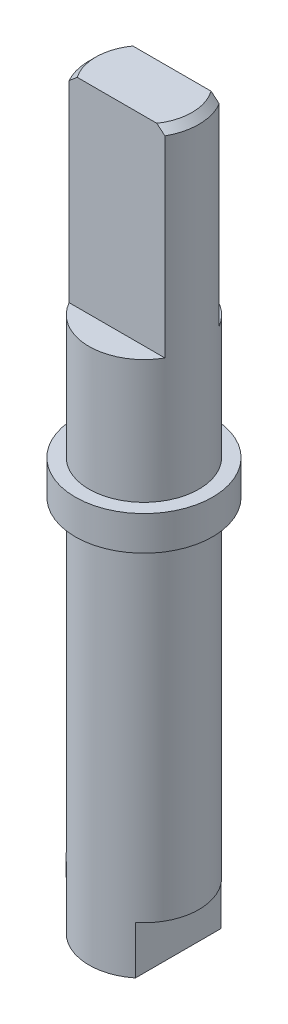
from build123d import *

# Parameters (mm, degrees)
SKETCH1_R           = 8
BOSS_EXTRUDE1_DEPTH = 53.5
CHAMFER1_SIZE       = 1
SKETCH2_R           = 10
BOSS_EXTRUDE2_DEPTH = 5
SKETCH3_OUTSIDE_W   = 44.136
SKETCH3_OUTSIDE_H   = 44.136
SKETCH3_OUTSIDE_W_2 = 21.314079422
SKETCH3_OUTSIDE_H_2 = 8
CUT_EXTRUDE1_DEPTH  = 29
SKETCH4_OUTSIDE_W   = 44.136
SKETCH4_OUTSIDE_H   = 44.136
SKETCH4_OUTSIDE_W_2 = 10
SKETCH4_OUTSIDE_H_2 = 28.810220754
CUT_EXTRUDE2_DEPTH  = 7


with BuildPart() as part:
    # Sketch1 → Boss-Extrude1 (new, symmetric)
    with BuildSketch(Plane(origin=(0, 0, 0), x_dir=(1, 0, 0), z_dir=(0, 1, 0))):
        with Locations(Location((0, 0, 0), (0, 0, 270))):
            Circle(SKETCH1_R)
    extrude(amount=BOSS_EXTRUDE1_DEPTH, both=True)

    # Chamfer1
    chamfer1_edges = [part.edges().sort_by_distance(p)[0] for p in [
        (0, 53.5, -8),
    ]]
    chamfer(chamfer1_edges, length=CHAMFER1_SIZE)

    # Sketch2 → Boss-Extrude2 (add)
    with BuildSketch(Plane(origin=(0, 6.5, 0), x_dir=(1, 0, 0), z_dir=(0, 1, 0))):
        with Locations(Location((0, 0, 0), (0, 0, 270))):
            Circle(SKETCH2_R)
    extrude(amount=-BOSS_EXTRUDE2_DEPTH)

    # Sketch3 outside → Cut-Extrude1 (cut)
    with BuildSketch(Plane(origin=(0, 53.5, 0), x_dir=(1, 0, 0), z_dir=(0, 1, 0))):
        Rectangle(SKETCH3_OUTSIDE_W, SKETCH3_OUTSIDE_H)
        with Locations((0.204621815, 0.076802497)):
            Rectangle(SKETCH3_OUTSIDE_W_2, SKETCH3_OUTSIDE_H_2, mode=Mode.SUBTRACT)
    extrude(amount=-CUT_EXTRUDE1_DEPTH, mode=Mode.SUBTRACT)

    # Sketch4 outside → Cut-Extrude2 (cut)
    with BuildSketch(Plane.XZ.offset(53.5)):
        Rectangle(SKETCH4_OUTSIDE_W, SKETCH4_OUTSIDE_H)
        Rectangle(SKETCH4_OUTSIDE_W_2, SKETCH4_OUTSIDE_H_2, mode=Mode.SUBTRACT)
    extrude(amount=-CUT_EXTRUDE2_DEPTH, mode=Mode.SUBTRACT)


solid = part.part
